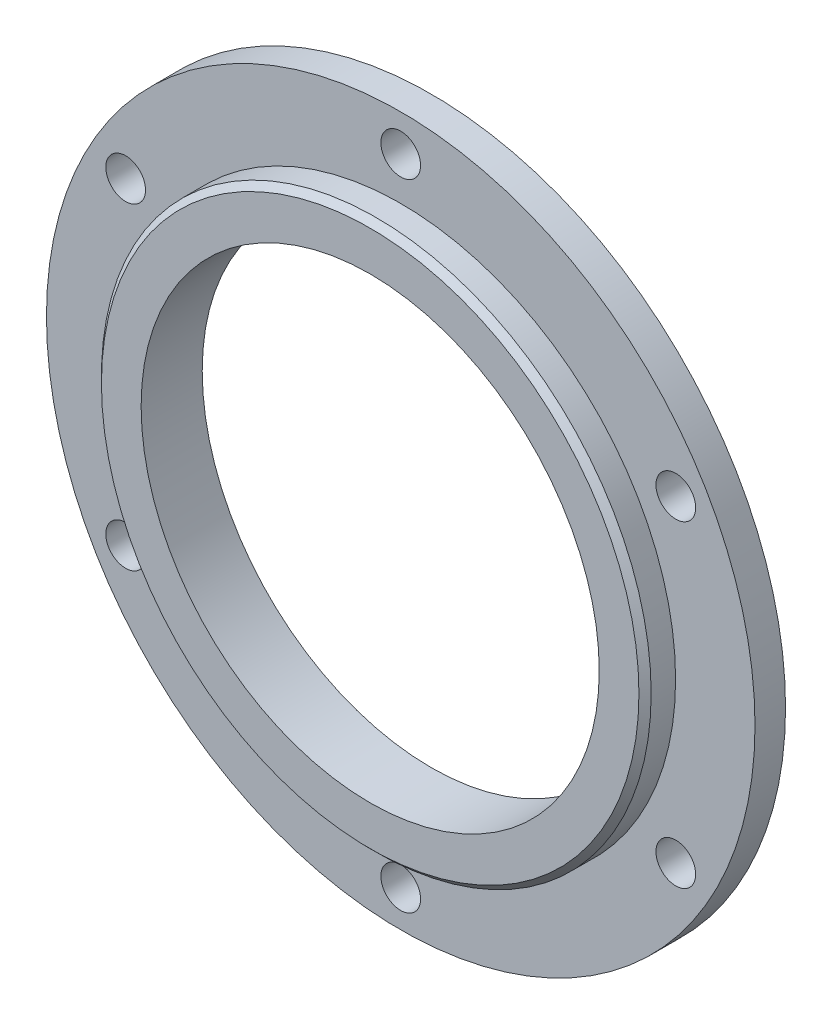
from build123d import *

# Parameters (mm, degrees)
ESQUISSE3_R      = 3.25
EXTRUSION1_DEPTH = 10


with BuildPart() as part:
    # Esquisse2 → R_volution1 (revolve)
    with BuildSketch(Plane(origin=(0, 0, 0), x_dir=(0, 0, -1), z_dir=(1, 0, 0)), mode=Mode.PRIVATE) as r_volution1_sk:
        Polygon((1, 45), (5, 45), (5, 58), (10, 58), (10, 37.5), (0, 37.5), (0, 44), align=None)
    revolve(r_volution1_sk.sketch.rotate(Axis((0, 0, 0), (0, 0, -1)), 90), axis=Axis((0, 0, 0), (0, 0, -1)))

    # Esquisse3 → Extrusion1 (cut)
    with BuildSketch(Plane.XY.offset(-5)):
        with Locations((0, 52)):
            Circle(ESQUISSE3_R)
        with Locations((45.033320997, 26)):
            Circle(ESQUISSE3_R)
        with Locations((45.033320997, -26)):
            Circle(ESQUISSE3_R)
        with Locations((0, -52)):
            Circle(ESQUISSE3_R)
        with Locations((-45.033320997, -26)):
            Circle(ESQUISSE3_R)
        with Locations((-45.033320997, 26)):
            Circle(ESQUISSE3_R)
    extrude(amount=-EXTRUSION1_DEPTH, mode=Mode.SUBTRACT)


solid = part.part
